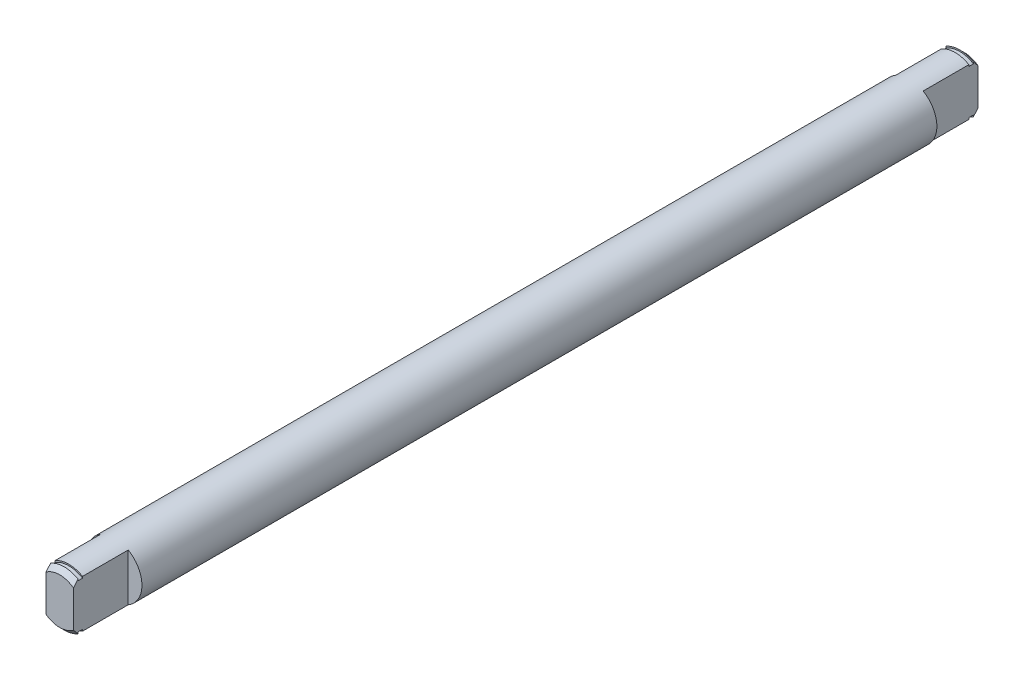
ISO-10303-21;
HEADER;
FILE_DESCRIPTION(('STEP AP214'),'2;1');
FILE_NAME('part.step','',(''),(''),'','','');
FILE_SCHEMA(('AUTOMOTIVE_DESIGN { 1 0 10303 214 1 1 1 1 }'));
ENDSEC;
DATA;
#1=APPLICATION_CONTEXT('core data for automotive mechanical design processes');
#2=APPLICATION_PROTOCOL_DEFINITION('international standard','automotive_design',2000,#1);
#3=PRODUCT_CONTEXT('',#1,'mechanical');
#4=PRODUCT('Part','Part','',(#3));
#5=PRODUCT_RELATED_PRODUCT_CATEGORY('part','',(#4));
#6=PRODUCT_DEFINITION_FORMATION('','',#4);
#7=PRODUCT_DEFINITION_CONTEXT('part definition',#1,'design');
#8=PRODUCT_DEFINITION('design','',#6,#7);
#9=PRODUCT_DEFINITION_SHAPE('','',#8);
#10=(LENGTH_UNIT() NAMED_UNIT(*) SI_UNIT(.MILLI.,.METRE.));
#11=(NAMED_UNIT(*) PLANE_ANGLE_UNIT() SI_UNIT($,.RADIAN.));
#12=(NAMED_UNIT(*) SI_UNIT($,.STERADIAN.) SOLID_ANGLE_UNIT());
#13=UNCERTAINTY_MEASURE_WITH_UNIT(LENGTH_MEASURE(1.E-05),#10,'distance_accuracy_value','');
#14=(GEOMETRIC_REPRESENTATION_CONTEXT(3) GLOBAL_UNCERTAINTY_ASSIGNED_CONTEXT((#13)) GLOBAL_UNIT_ASSIGNED_CONTEXT((#10,
#11,#12)) REPRESENTATION_CONTEXT('',''));
#15=CARTESIAN_POINT('',(0.,0.,0.));
#16=DIRECTION('',(0.,0.,1.));
#17=DIRECTION('',(1.,0.,0.));
#18=AXIS2_PLACEMENT_3D('',#15,#16,#17);
#19=CARTESIAN_POINT('',(0.,0.,49.5));
#20=DIRECTION('',(0.,0.,-1.));
#21=DIRECTION('',(-1.,0.,0.));
#22=AXIS2_PLACEMENT_3D('',#19,#20,#21);
#23=CYLINDRICAL_SURFACE('',#22,3.);
#24=DIRECTION('',(0.,0.,-1.));
#25=VECTOR('',#24,1.);
#26=CARTESIAN_POINT('',(-1.5,2.59807621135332,49.5));
#27=LINE('',#26,#25);
#28=CARTESIAN_POINT('',(-1.5,2.59807621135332,48.5));
#29=VERTEX_POINT('',#28);
#30=CARTESIAN_POINT('',(-1.5,2.59807621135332,43.5));
#31=VERTEX_POINT('',#30);
#32=EDGE_CURVE('E354',#29,#31,#27,.T.);
#33=ORIENTED_EDGE('',*,*,#32,.F.);
#34=CARTESIAN_POINT('',(0.,0.,48.5));
#35=DIRECTION('',(0.,0.,-1.));
#36=DIRECTION('',(-1.,0.,0.));
#37=AXIS2_PLACEMENT_3D('',#34,#35,#36);
#38=CIRCLE('',#37,3.);
#39=CARTESIAN_POINT('',(1.5,2.59807621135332,48.5));
#40=VERTEX_POINT('',#39);
#41=EDGE_CURVE('E318',#29,#40,#38,.T.);
#42=ORIENTED_EDGE('',*,*,#41,.T.);
#43=DIRECTION('',(0.,0.,-1.));
#44=VECTOR('',#43,1.);
#45=CARTESIAN_POINT('',(1.5,2.59807621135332,49.5));
#46=LINE('',#45,#44);
#47=CARTESIAN_POINT('',(1.5,2.59807621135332,43.5));
#48=VERTEX_POINT('',#47);
#49=EDGE_CURVE('E390',#48,#40,#46,.F.);
#50=ORIENTED_EDGE('',*,*,#49,.F.);
#51=CARTESIAN_POINT('',(0.,0.,43.5));
#52=DIRECTION('',(0.,0.,1.));
#53=DIRECTION('',(1.,0.,0.));
#54=AXIS2_PLACEMENT_3D('',#51,#52,#53);
#55=CIRCLE('',#54,3.);
#56=CARTESIAN_POINT('',(1.5,-2.59807621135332,43.5));
#57=VERTEX_POINT('',#56);
#58=EDGE_CURVE('E36',#57,#48,#55,.T.);
#59=ORIENTED_EDGE('',*,*,#58,.F.);
#60=DIRECTION('',(0.,0.,-1.));
#61=VECTOR('',#60,1.);
#62=CARTESIAN_POINT('',(1.5,-2.59807621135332,49.5));
#63=LINE('',#62,#61);
#64=CARTESIAN_POINT('',(1.5,-2.59807621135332,48.5));
#65=VERTEX_POINT('',#64);
#66=EDGE_CURVE('E395',#65,#57,#63,.T.);
#67=ORIENTED_EDGE('',*,*,#66,.F.);
#68=CARTESIAN_POINT('',(-1.5,-2.59807621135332,48.5));
#69=VERTEX_POINT('',#68);
#70=EDGE_CURVE('E420',#65,#69,#38,.T.);
#71=ORIENTED_EDGE('',*,*,#70,.T.);
#72=DIRECTION('',(0.,0.,-1.));
#73=VECTOR('',#72,1.);
#74=CARTESIAN_POINT('',(-1.5,-2.59807621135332,49.5));
#75=LINE('',#74,#73);
#76=CARTESIAN_POINT('',(-1.5,-2.59807621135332,43.5));
#77=VERTEX_POINT('',#76);
#78=EDGE_CURVE('E403',#77,#69,#75,.F.);
#79=ORIENTED_EDGE('',*,*,#78,.F.);
#80=EDGE_CURVE('E12',#31,#77,#55,.T.);
#81=ORIENTED_EDGE('',*,*,#80,.F.);
#82=EDGE_LOOP('',(#33,#42,#50,#59,#67,#71,#79,#81));
#83=FACE_BOUND('',#82,.T.);
#84=DIRECTION('',(0.,0.,1.));
#85=VECTOR('',#84,1.);
#86=CARTESIAN_POINT('',(-1.5,2.59807621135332,-49.5));
#87=LINE('',#86,#85);
#88=CARTESIAN_POINT('',(-1.5,2.59807621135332,-48.5));
#89=VERTEX_POINT('',#88);
#90=CARTESIAN_POINT('',(-1.5,2.59807621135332,-43.5));
#91=VERTEX_POINT('',#90);
#92=EDGE_CURVE('E260',#89,#91,#87,.T.);
#93=ORIENTED_EDGE('',*,*,#92,.T.);
#94=CARTESIAN_POINT('',(0.,0.,-43.5));
#95=DIRECTION('',(0.,0.,1.));
#96=DIRECTION('',(1.,0.,0.));
#97=AXIS2_PLACEMENT_3D('',#94,#95,#96);
#98=CIRCLE('',#97,3.);
#99=CARTESIAN_POINT('',(-1.5,-2.59807621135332,-43.5));
#100=VERTEX_POINT('',#99);
#101=EDGE_CURVE('E360',#91,#100,#98,.T.);
#102=ORIENTED_EDGE('',*,*,#101,.T.);
#103=DIRECTION('',(0.,0.,1.));
#104=VECTOR('',#103,1.);
#105=CARTESIAN_POINT('',(-1.5,-2.59807621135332,-49.5));
#106=LINE('',#105,#104);
#107=CARTESIAN_POINT('',(-1.5,-2.59807621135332,-48.5));
#108=VERTEX_POINT('',#107);
#109=EDGE_CURVE('E254',#100,#108,#106,.F.);
#110=ORIENTED_EDGE('',*,*,#109,.T.);
#111=CARTESIAN_POINT('',(0.,0.,-48.5));
#112=DIRECTION('',(0.,0.,-1.));
#113=DIRECTION('',(-1.,0.,0.));
#114=AXIS2_PLACEMENT_3D('',#111,#112,#113);
#115=CIRCLE('',#114,3.);
#116=CARTESIAN_POINT('',(1.5,-2.59807621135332,-48.5));
#117=VERTEX_POINT('',#116);
#118=EDGE_CURVE('E273',#117,#108,#115,.T.);
#119=ORIENTED_EDGE('',*,*,#118,.F.);
#120=DIRECTION('',(0.,0.,1.));
#121=VECTOR('',#120,1.);
#122=CARTESIAN_POINT('',(1.5,-2.59807621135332,-49.5));
#123=LINE('',#122,#121);
#124=CARTESIAN_POINT('',(1.5,-2.59807621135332,-43.5));
#125=VERTEX_POINT('',#124);
#126=EDGE_CURVE('E241',#117,#125,#123,.T.);
#127=ORIENTED_EDGE('',*,*,#126,.T.);
#128=CARTESIAN_POINT('',(1.5,2.59807621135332,-43.5));
#129=VERTEX_POINT('',#128);
#130=EDGE_CURVE('E369',#125,#129,#98,.T.);
#131=ORIENTED_EDGE('',*,*,#130,.T.);
#132=DIRECTION('',(0.,0.,1.));
#133=VECTOR('',#132,1.);
#134=CARTESIAN_POINT('',(1.5,2.59807621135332,-49.5));
#135=LINE('',#134,#133);
#136=CARTESIAN_POINT('',(1.5,2.59807621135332,-48.5));
#137=VERTEX_POINT('',#136);
#138=EDGE_CURVE('E235',#129,#137,#135,.F.);
#139=ORIENTED_EDGE('',*,*,#138,.T.);
#140=EDGE_CURVE('E214',#89,#137,#115,.T.);
#141=ORIENTED_EDGE('',*,*,#140,.F.);
#142=EDGE_LOOP('',(#93,#102,#110,#119,#127,#131,#139,#141));
#143=FACE_BOUND('',#142,.T.);
#144=ADVANCED_FACE('F33',(#83,#143),#23,.T.);
#145=CARTESIAN_POINT('',(0.,4.74620758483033,48.5));
#146=DIRECTION('',(0.,0.,-1.));
#147=DIRECTION('',(-1.,0.,0.));
#148=AXIS2_PLACEMENT_3D('',#145,#146,#147);
#149=PLANE('',#148);
#150=DIRECTION('',(0.,1.,0.));
#151=VECTOR('',#150,1.);
#152=CARTESIAN_POINT('',(-1.5,4.74620758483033,48.5));
#153=LINE('',#152,#151);
#154=CARTESIAN_POINT('',(-1.5,-2.42332416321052,48.5));
#155=VERTEX_POINT('',#154);
#156=EDGE_CURVE('E401',#69,#155,#153,.T.);
#157=ORIENTED_EDGE('',*,*,#156,.F.);
#158=ORIENTED_EDGE('',*,*,#70,.F.);
#159=DIRECTION('',(0.,-1.,0.));
#160=VECTOR('',#159,1.);
#161=CARTESIAN_POINT('',(1.5,4.74620758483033,48.5));
#162=LINE('',#161,#160);
#163=CARTESIAN_POINT('',(1.5,-2.42332416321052,48.5));
#164=VERTEX_POINT('',#163);
#165=EDGE_CURVE('E391',#164,#65,#162,.T.);
#166=ORIENTED_EDGE('',*,*,#165,.F.);
#167=CARTESIAN_POINT('',(0.,0.,48.5));
#168=DIRECTION('',(0.,0.,-1.));
#169=DIRECTION('',(-1.,0.,0.));
#170=AXIS2_PLACEMENT_3D('',#167,#168,#169);
#171=CIRCLE('',#170,2.84999999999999);
#172=EDGE_CURVE('E413',#164,#155,#171,.T.);
#173=ORIENTED_EDGE('',*,*,#172,.T.);
#174=EDGE_LOOP('',(#157,#158,#166,#173));
#175=FACE_BOUND('',#174,.T.);
#176=ADVANCED_FACE('F330',(#175),#149,.F.);
#177=CARTESIAN_POINT('',(-1.5,2.42332416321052,48.5));
#178=VERTEX_POINT('',#177);
#179=EDGE_CURVE('E404',#178,#29,#153,.T.);
#180=ORIENTED_EDGE('',*,*,#179,.F.);
#181=CARTESIAN_POINT('',(1.5,2.42332416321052,48.5));
#182=VERTEX_POINT('',#181);
#183=EDGE_CURVE('E414',#178,#182,#171,.T.);
#184=ORIENTED_EDGE('',*,*,#183,.T.);
#185=EDGE_CURVE('E388',#40,#182,#162,.T.);
#186=ORIENTED_EDGE('',*,*,#185,.F.);
#187=ORIENTED_EDGE('',*,*,#41,.F.);
#188=EDGE_LOOP('',(#180,#184,#186,#187));
#189=FACE_BOUND('',#188,.T.);
#190=ADVANCED_FACE('F348',(#189),#149,.F.);
#191=CARTESIAN_POINT('',(0.,0.,0.));
#192=DIRECTION('',(0.,0.,-1.));
#193=DIRECTION('',(-1.,0.,0.));
#194=AXIS2_PLACEMENT_3D('',#191,#192,#193);
#195=CYLINDRICAL_SURFACE('',#194,2.84999999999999);
#196=DIRECTION('',(0.,0.,-1.));
#197=VECTOR('',#196,1.);
#198=CARTESIAN_POINT('',(-1.5,2.42332416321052,0.));
#199=LINE('',#198,#197);
#200=CARTESIAN_POINT('',(-1.5,2.42332416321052,49.));
#201=VERTEX_POINT('',#200);
#202=EDGE_CURVE('E406',#201,#178,#199,.T.);
#203=ORIENTED_EDGE('',*,*,#202,.F.);
#204=CARTESIAN_POINT('',(0.,0.,49.));
#205=DIRECTION('',(0.,0.,-1.));
#206=DIRECTION('',(-1.,0.,0.));
#207=AXIS2_PLACEMENT_3D('',#204,#205,#206);
#208=CIRCLE('',#207,2.84999999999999);
#209=CARTESIAN_POINT('',(1.5,2.42332416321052,49.));
#210=VERTEX_POINT('',#209);
#211=EDGE_CURVE('E410',#201,#210,#208,.T.);
#212=ORIENTED_EDGE('',*,*,#211,.T.);
#213=DIRECTION('',(0.,0.,-1.));
#214=VECTOR('',#213,1.);
#215=CARTESIAN_POINT('',(1.5,2.42332416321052,0.));
#216=LINE('',#215,#214);
#217=EDGE_CURVE('E385',#182,#210,#216,.F.);
#218=ORIENTED_EDGE('',*,*,#217,.F.);
#219=ORIENTED_EDGE('',*,*,#183,.F.);
#220=EDGE_LOOP('',(#203,#212,#218,#219));
#221=FACE_BOUND('',#220,.T.);
#222=ADVANCED_FACE('F462',(#221),#195,.T.);
#223=DIRECTION('',(0.,0.,-1.));
#224=VECTOR('',#223,1.);
#225=CARTESIAN_POINT('',(-1.5,-2.42332416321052,0.));
#226=LINE('',#225,#224);
#227=CARTESIAN_POINT('',(-1.5,-2.42332416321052,49.));
#228=VERTEX_POINT('',#227);
#229=EDGE_CURVE('E398',#155,#228,#226,.F.);
#230=ORIENTED_EDGE('',*,*,#229,.F.);
#231=ORIENTED_EDGE('',*,*,#172,.F.);
#232=DIRECTION('',(0.,0.,-1.));
#233=VECTOR('',#232,1.);
#234=CARTESIAN_POINT('',(1.5,-2.42332416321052,0.));
#235=LINE('',#234,#233);
#236=CARTESIAN_POINT('',(1.5,-2.42332416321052,49.));
#237=VERTEX_POINT('',#236);
#238=EDGE_CURVE('E393',#237,#164,#235,.T.);
#239=ORIENTED_EDGE('',*,*,#238,.F.);
#240=EDGE_CURVE('E409',#237,#228,#208,.T.);
#241=ORIENTED_EDGE('',*,*,#240,.T.);
#242=EDGE_LOOP('',(#230,#231,#239,#241));
#243=FACE_BOUND('',#242,.T.);
#244=ADVANCED_FACE('F441',(#243),#195,.T.);
#245=CARTESIAN_POINT('',(0.,4.74620758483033,49.));
#246=DIRECTION('',(0.,0.,1.));
#247=DIRECTION('',(1.,0.,0.));
#248=AXIS2_PLACEMENT_3D('',#245,#246,#247);
#249=PLANE('',#248);
#250=DIRECTION('',(0.,-1.,0.));
#251=VECTOR('',#250,1.);
#252=CARTESIAN_POINT('',(-1.5,4.74620758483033,49.));
#253=LINE('',#252,#251);
#254=CARTESIAN_POINT('',(-1.5,2.59807621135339,49.));
#255=VERTEX_POINT('',#254);
#256=EDGE_CURVE('E399',#255,#201,#253,.T.);
#257=ORIENTED_EDGE('',*,*,#256,.F.);
#258=CARTESIAN_POINT('',(0.,0.,49.));
#259=DIRECTION('',(0.,0.,1.));
#260=DIRECTION('',(1.,0.,0.));
#261=AXIS2_PLACEMENT_3D('',#258,#259,#260);
#262=CIRCLE('',#261,2.99999999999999);
#263=CARTESIAN_POINT('',(1.5,2.59807621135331,49.));
#264=VERTEX_POINT('',#263);
#265=EDGE_CURVE('E417',#255,#264,#262,.F.);
#266=ORIENTED_EDGE('',*,*,#265,.T.);
#267=DIRECTION('',(0.,1.,0.));
#268=VECTOR('',#267,1.);
#269=CARTESIAN_POINT('',(1.5,4.74620758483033,49.));
#270=LINE('',#269,#268);
#271=EDGE_CURVE('E47',#210,#264,#270,.T.);
#272=ORIENTED_EDGE('',*,*,#271,.F.);
#273=ORIENTED_EDGE('',*,*,#211,.F.);
#274=EDGE_LOOP('',(#257,#266,#272,#273));
#275=FACE_BOUND('',#274,.T.);
#276=ADVANCED_FACE('F339',(#275),#249,.F.);
#277=CARTESIAN_POINT('',(-1.5,-2.59807621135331,49.));
#278=VERTEX_POINT('',#277);
#279=EDGE_CURVE('E55',#228,#278,#253,.T.);
#280=ORIENTED_EDGE('',*,*,#279,.F.);
#281=ORIENTED_EDGE('',*,*,#240,.F.);
#282=CARTESIAN_POINT('',(1.5,-2.59807621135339,49.));
#283=VERTEX_POINT('',#282);
#284=EDGE_CURVE('E386',#283,#237,#270,.T.);
#285=ORIENTED_EDGE('',*,*,#284,.F.);
#286=EDGE_CURVE('E418',#283,#278,#262,.F.);
#287=ORIENTED_EDGE('',*,*,#286,.T.);
#288=EDGE_LOOP('',(#280,#281,#285,#287));
#289=FACE_BOUND('',#288,.T.);
#290=ADVANCED_FACE('F334',(#289),#249,.F.);
#291=CARTESIAN_POINT('',(0.,0.,49.5));
#292=DIRECTION('',(0.,0.,1.));
#293=DIRECTION('',(1.,0.,0.));
#294=AXIS2_PLACEMENT_3D('',#291,#292,#293);
#295=PLANE('',#294);
#296=CARTESIAN_POINT('',(0.,0.,49.5));
#297=DIRECTION('',(0.,0.,1.));
#298=DIRECTION('',(1.,0.,0.));
#299=AXIS2_PLACEMENT_3D('',#296,#297,#298);
#300=CIRCLE('',#299,2.5);
#301=CARTESIAN_POINT('',(1.5,1.99999999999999,49.5));
#302=VERTEX_POINT('',#301);
#303=CARTESIAN_POINT('',(-1.5,1.99999999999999,49.5));
#304=VERTEX_POINT('',#303);
#305=EDGE_CURVE('E317',#302,#304,#300,.T.);
#306=ORIENTED_EDGE('',*,*,#305,.T.);
#307=DIRECTION('',(0.,-1.,0.));
#308=VECTOR('',#307,1.);
#309=CARTESIAN_POINT('',(-1.5,5.,49.5));
#310=LINE('',#309,#308);
#311=CARTESIAN_POINT('',(-1.5,-1.99999999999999,49.5));
#312=VERTEX_POINT('',#311);
#313=EDGE_CURVE('E368',#304,#312,#310,.T.);
#314=ORIENTED_EDGE('',*,*,#313,.T.);
#315=CARTESIAN_POINT('',(1.5,-1.99999999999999,49.5));
#316=VERTEX_POINT('',#315);
#317=EDGE_CURVE('E422',#312,#316,#300,.T.);
#318=ORIENTED_EDGE('',*,*,#317,.T.);
#319=DIRECTION('',(0.,1.,0.));
#320=VECTOR('',#319,1.);
#321=CARTESIAN_POINT('',(1.5,5.,49.5));
#322=LINE('',#321,#320);
#323=EDGE_CURVE('E371',#316,#302,#322,.T.);
#324=ORIENTED_EDGE('',*,*,#323,.T.);
#325=EDGE_LOOP('',(#306,#314,#318,#324));
#326=FACE_BOUND('',#325,.T.);
#327=ADVANCED_FACE('F328',(#326),#295,.T.);
#328=CARTESIAN_POINT('',(0.,0.,49.5));
#329=DIRECTION('',(0.,0.,-1.));
#330=DIRECTION('',(-1.,0.,0.));
#331=AXIS2_PLACEMENT_3D('',#328,#329,#330);
#332=CONICAL_SURFACE('',#331,2.5,0.785398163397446);
#333=ORIENTED_EDGE('',*,*,#265,.F.);
#334=CARTESIAN_POINT('',(-1.5,6.44030397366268,45.3873216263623));
#335=CARTESIAN_POINT('',(-1.5,6.27835677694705,45.5450370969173));
#336=CARTESIAN_POINT('',(-1.5,6.11626608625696,45.7026057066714));
#337=CARTESIAN_POINT('',(-1.5,5.79169279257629,46.0173501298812));
#338=CARTESIAN_POINT('',(-1.5,5.62921017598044,46.1745259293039));
#339=CARTESIAN_POINT('',(-1.5,5.30336474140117,46.4887552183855));
#340=CARTESIAN_POINT('',(-1.5,5.14000074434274,46.6458074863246));
#341=CARTESIAN_POINT('',(-1.5,4.81263846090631,46.9592405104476));
#342=CARTESIAN_POINT('',(-1.5,4.64864019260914,47.1156212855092));
#343=CARTESIAN_POINT('',(-1.5,4.29574135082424,47.4502970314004));
#344=CARTESIAN_POINT('',(-1.5,4.10670721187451,47.6284514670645));
#345=CARTESIAN_POINT('',(-1.5,3.72700159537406,47.9830448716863));
#346=CARTESIAN_POINT('',(-1.5,3.53632996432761,48.1594836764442));
#347=CARTESIAN_POINT('',(-1.5,3.15288488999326,48.5093775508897));
#348=CARTESIAN_POINT('',(-1.5,2.96011589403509,48.6828374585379));
#349=CARTESIAN_POINT('',(-1.5,2.6679792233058,48.9396076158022));
#350=CARTESIAN_POINT('',(-1.5,2.57011081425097,49.0246212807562));
#351=CARTESIAN_POINT('',(-1.5,2.37304745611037,49.1930942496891));
#352=CARTESIAN_POINT('',(-1.5,2.27385257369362,49.2765536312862));
#353=CARTESIAN_POINT('',(-1.5,2.10981416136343,49.4115631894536));
#354=CARTESIAN_POINT('',(-1.5,2.0454989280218,49.4637545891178));
#355=CARTESIAN_POINT('',(-1.5,1.91596831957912,49.5670178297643));
#356=CARTESIAN_POINT('',(-1.5,1.85075290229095,49.6180896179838));
#357=CARTESIAN_POINT('',(-1.5,1.71900835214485,49.7189504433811));
#358=CARTESIAN_POINT('',(-1.5,1.6524757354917,49.7687349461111));
#359=CARTESIAN_POINT('',(-1.5,1.5180264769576,49.8663957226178));
#360=CARTESIAN_POINT('',(-1.5,1.4501099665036,49.9142721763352));
#361=CARTESIAN_POINT('',(-1.5,1.31444992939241,50.0061703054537));
#362=CARTESIAN_POINT('',(-1.5,1.24675428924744,50.050262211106));
#363=CARTESIAN_POINT('',(-1.5,1.10927413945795,50.1351775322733));
#364=CARTESIAN_POINT('',(-1.5,1.0394886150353,50.1759993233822));
#365=CARTESIAN_POINT('',(-1.5,0.897766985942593,50.2528721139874));
#366=CARTESIAN_POINT('',(-1.5,0.82584362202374,50.2889463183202));
#367=CARTESIAN_POINT('',(-1.5,0.679166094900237,50.3547083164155));
#368=CARTESIAN_POINT('',(-1.5,0.604416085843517,50.3844050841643));
#369=CARTESIAN_POINT('',(-1.5,0.484591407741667,50.424202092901));
#370=CARTESIAN_POINT('',(-1.5,0.440496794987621,50.4372516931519));
#371=CARTESIAN_POINT('',(-1.5,0.351423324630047,50.4599854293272));
#372=CARTESIAN_POINT('',(-1.5,0.306444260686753,50.4696687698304));
#373=CARTESIAN_POINT('',(-1.5,0.216009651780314,50.4851780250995));
#374=CARTESIAN_POINT('',(-1.5,0.170556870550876,50.4910198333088));
#375=CARTESIAN_POINT('',(-1.5,0.0793114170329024,50.4985924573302));
#376=CARTESIAN_POINT('',(-1.5,0.033518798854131,50.50032391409));
#377=CARTESIAN_POINT('',(-1.5,-0.0581530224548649,50.4995749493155));
#378=CARTESIAN_POINT('',(-1.5,-0.104032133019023,50.4970833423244));
#379=CARTESIAN_POINT('',(-1.5,-0.195380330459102,50.4880123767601));
#380=CARTESIAN_POINT('',(-1.5,-0.240849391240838,50.4814327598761));
#381=CARTESIAN_POINT('',(-1.5,-0.331269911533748,50.4645010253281));
#382=CARTESIAN_POINT('',(-1.5,-0.37621835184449,50.45413300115));
#383=CARTESIAN_POINT('',(-1.5,-0.465213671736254,50.4300993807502));
#384=CARTESIAN_POINT('',(-1.5,-0.509260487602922,50.416433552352));
#385=CARTESIAN_POINT('',(-1.5,-0.649833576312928,50.3678292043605));
#386=CARTESIAN_POINT('',(-1.5,-0.744448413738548,50.3273611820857));
#387=CARTESIAN_POINT('',(-1.5,-0.929265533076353,50.2373341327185));
#388=CARTESIAN_POINT('',(-1.5,-1.01945854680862,50.1877569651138));
#389=CARTESIAN_POINT('',(-1.5,-1.19690759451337,50.0823263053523));
#390=CARTESIAN_POINT('',(-1.5,-1.2841387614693,50.026431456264));
#391=CARTESIAN_POINT('',(-1.5,-1.41287692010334,49.9396045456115));
#392=CARTESIAN_POINT('',(-1.5,-1.45541988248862,49.9101784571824));
#393=CARTESIAN_POINT('',(-1.5,-1.53990886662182,49.8504826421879));
#394=CARTESIAN_POINT('',(-1.5,-1.58185490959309,49.8202129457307));
#395=CARTESIAN_POINT('',(-1.5,-1.71506556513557,49.7223748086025));
#396=CARTESIAN_POINT('',(-1.5,-1.80534910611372,49.6534717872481));
#397=CARTESIAN_POINT('',(-1.5,-1.98408798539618,49.5133270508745));
#398=CARTESIAN_POINT('',(-1.5,-2.07254304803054,49.4420849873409));
#399=CARTESIAN_POINT('',(-1.5,-2.24810196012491,49.2978795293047));
#400=CARTESIAN_POINT('',(-1.5,-2.33520518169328,49.2249153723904));
#401=CARTESIAN_POINT('',(-1.5,-2.50833922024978,49.0777236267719));
#402=CARTESIAN_POINT('',(-1.5,-2.59437000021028,49.0034959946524));
#403=CARTESIAN_POINT('',(-1.5,-2.85149237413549,48.779141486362));
#404=CARTESIAN_POINT('',(-1.5,-3.02133035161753,48.6275795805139));
#405=CARTESIAN_POINT('',(-1.5,-3.35882124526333,48.3221484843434));
#406=CARTESIAN_POINT('',(-1.5,-3.52647473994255,48.1682799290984));
#407=CARTESIAN_POINT('',(-1.5,-3.85983495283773,47.8594198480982));
#408=CARTESIAN_POINT('',(-1.5,-4.02554592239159,47.7044329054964));
#409=CARTESIAN_POINT('',(-1.5,-4.35594593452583,47.3933535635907));
#410=CARTESIAN_POINT('',(-1.5,-4.52063490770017,47.2372610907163));
#411=CARTESIAN_POINT('',(-1.5,-5.0133324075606,46.7680443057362));
#412=CARTESIAN_POINT('',(-1.5,-5.34022261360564,46.4537460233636));
#413=CARTESIAN_POINT('',(-1.5,-5.73087171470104,46.0760963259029));
#414=CARTESIAN_POINT('',(-1.5,-5.79545591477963,46.0135939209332));
#415=CARTESIAN_POINT('',(-1.5,-5.92456669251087,45.8885165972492));
#416=CARTESIAN_POINT('',(-1.5,-5.98909326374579,45.8259416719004));
#417=CARTESIAN_POINT('',(-1.5,-6.11810091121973,45.7007207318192));
#418=CARTESIAN_POINT('',(-1.5,-6.18258197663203,45.6380747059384));
#419=CARTESIAN_POINT('',(-1.5,-6.31148470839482,45.5127345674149));
#420=CARTESIAN_POINT('',(-1.5,-6.37590638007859,45.4500404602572));
#421=CARTESIAN_POINT('',(-1.5,-6.44030397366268,45.3873216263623));
#422=B_SPLINE_CURVE_WITH_KNOTS('',3,(#334,#335,#336,#337,#338,#339,#340,#341,#342,#343,#344,
#345,#346,#347,#348,#349,#350,#351,#352,#353,#354,#355,#356,#357,#358,#359,#360,#361,#362,#363,
#364,#365,#366,#367,#368,#369,#370,#371,#372,#373,#374,#375,#376,#377,#378,#379,#380,#381,#382,
#383,#384,#385,#386,#387,#388,#389,#390,#391,#392,#393,#394,#395,#396,#397,#398,#399,#400,#401,
#402,#403,#404,#405,#406,#407,#408,#409,#410,#411,#412,#413,#414,#415,#416,#417,#418,#419,#420,
#421),.UNSPECIFIED.,.F.,.F.,(4,2,2,2,2,2,2,2,2,2,2,2,2,2,2,2,2,2,2,2,2,2,2,2,2,2,2,2,2,2,2,2,2,
2,2,2,2,2,2,2,2,2,2,4),(0.,0.67816673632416,1.35635736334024,2.03619323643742,2.7160098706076,
3.49526817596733,4.27460034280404,5.05251678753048,5.44141491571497,5.83029357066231,
6.07876659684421,6.32725130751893,6.57651673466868,6.82575859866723,7.06805724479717,
7.31047551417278,7.55166103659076,7.79250491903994,7.93035124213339,8.06823011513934,
8.20553489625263,8.34281826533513,8.48046581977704,8.61812207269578,8.75636307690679,
8.89461381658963,9.20247327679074,9.51095260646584,9.82158311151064,9.97676134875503,
10.131934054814,10.4725892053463,10.813295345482,11.1541552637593,11.4950269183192,
12.1778780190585,12.860544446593,13.5412201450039,14.2219415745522,15.5823535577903,
15.8519812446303,16.1216359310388,16.3913412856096,16.66101944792),.UNSPECIFIED.);
#423=EDGE_CURVE('E448',#255,#304,#422,.T.);
#424=ORIENTED_EDGE('',*,*,#423,.T.);
#425=ORIENTED_EDGE('',*,*,#305,.F.);
#426=CARTESIAN_POINT('',(1.5,-6.44030397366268,45.3873216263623));
#427=CARTESIAN_POINT('',(1.5,-6.27835677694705,45.5450370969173));
#428=CARTESIAN_POINT('',(1.5,-6.11626608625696,45.7026057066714));
#429=CARTESIAN_POINT('',(1.5,-5.79169279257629,46.0173501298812));
#430=CARTESIAN_POINT('',(1.5,-5.62921017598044,46.1745259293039));
#431=CARTESIAN_POINT('',(1.5,-5.30336474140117,46.4887552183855));
#432=CARTESIAN_POINT('',(1.5,-5.14000074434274,46.6458074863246));
#433=CARTESIAN_POINT('',(1.5,-4.81263846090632,46.9592405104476));
#434=CARTESIAN_POINT('',(1.5,-4.64864019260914,47.1156212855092));
#435=CARTESIAN_POINT('',(1.5,-4.29574135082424,47.4502970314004));
#436=CARTESIAN_POINT('',(1.5,-4.10670721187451,47.6284514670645));
#437=CARTESIAN_POINT('',(1.5,-3.72700159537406,47.9830448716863));
#438=CARTESIAN_POINT('',(1.5,-3.53632996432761,48.1594836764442));
#439=CARTESIAN_POINT('',(1.5,-3.15288488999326,48.5093775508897));
#440=CARTESIAN_POINT('',(1.5,-2.96011589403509,48.6828374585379));
#441=CARTESIAN_POINT('',(1.5,-2.6679792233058,48.9396076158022));
#442=CARTESIAN_POINT('',(1.5,-2.57011081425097,49.0246212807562));
#443=CARTESIAN_POINT('',(1.5,-2.37304745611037,49.1930942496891));
#444=CARTESIAN_POINT('',(1.5,-2.27385257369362,49.2765536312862));
#445=CARTESIAN_POINT('',(1.5,-2.10981416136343,49.4115631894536));
#446=CARTESIAN_POINT('',(1.5,-2.0454989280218,49.4637545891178));
#447=CARTESIAN_POINT('',(1.5,-1.91596831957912,49.5670178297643));
#448=CARTESIAN_POINT('',(1.5,-1.85075290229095,49.6180896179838));
#449=CARTESIAN_POINT('',(1.5,-1.71900835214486,49.7189504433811));
#450=CARTESIAN_POINT('',(1.5,-1.6524757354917,49.7687349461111));
#451=CARTESIAN_POINT('',(1.5,-1.5180264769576,49.8663957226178));
#452=CARTESIAN_POINT('',(1.5,-1.4501099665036,49.9142721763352));
#453=CARTESIAN_POINT('',(1.5,-1.31444992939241,50.0061703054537));
#454=CARTESIAN_POINT('',(1.5,-1.24675428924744,50.050262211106));
#455=CARTESIAN_POINT('',(1.5,-1.10927413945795,50.1351775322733));
#456=CARTESIAN_POINT('',(1.5,-1.0394886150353,50.1759993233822));
#457=CARTESIAN_POINT('',(1.5,-0.897766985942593,50.2528721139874));
#458=CARTESIAN_POINT('',(1.5,-0.825843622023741,50.2889463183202));
#459=CARTESIAN_POINT('',(1.5,-0.679166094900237,50.3547083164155));
#460=CARTESIAN_POINT('',(1.5,-0.604416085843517,50.3844050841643));
#461=CARTESIAN_POINT('',(1.5,-0.484591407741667,50.424202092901));
#462=CARTESIAN_POINT('',(1.5,-0.440496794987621,50.4372516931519));
#463=CARTESIAN_POINT('',(1.5,-0.351423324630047,50.4599854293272));
#464=CARTESIAN_POINT('',(1.5,-0.306444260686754,50.4696687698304));
#465=CARTESIAN_POINT('',(1.5,-0.216009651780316,50.4851780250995));
#466=CARTESIAN_POINT('',(1.5,-0.170556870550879,50.4910198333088));
#467=CARTESIAN_POINT('',(1.5,-0.0793114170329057,50.4985924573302));
#468=CARTESIAN_POINT('',(1.5,-0.0335187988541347,50.50032391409));
#469=CARTESIAN_POINT('',(1.5,0.0581530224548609,50.4995749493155));
#470=CARTESIAN_POINT('',(1.5,0.104032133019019,50.4970833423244));
#471=CARTESIAN_POINT('',(1.5,0.195380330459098,50.4880123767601));
#472=CARTESIAN_POINT('',(1.5,0.240849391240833,50.4814327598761));
#473=CARTESIAN_POINT('',(1.5,0.331269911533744,50.4645010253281));
#474=CARTESIAN_POINT('',(1.5,0.376218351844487,50.45413300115));
#475=CARTESIAN_POINT('',(1.5,0.46521367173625,50.4300993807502));
#476=CARTESIAN_POINT('',(1.5,0.509260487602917,50.416433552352));
#477=CARTESIAN_POINT('',(1.5,0.649833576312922,50.3678292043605));
#478=CARTESIAN_POINT('',(1.5,0.744448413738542,50.3273611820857));
#479=CARTESIAN_POINT('',(1.5,0.929265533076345,50.2373341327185));
#480=CARTESIAN_POINT('',(1.5,1.01945854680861,50.1877569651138));
#481=CARTESIAN_POINT('',(1.5,1.19690759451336,50.0823263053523));
#482=CARTESIAN_POINT('',(1.5,1.28413876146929,50.026431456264));
#483=CARTESIAN_POINT('',(1.5,1.41287692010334,49.9396045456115));
#484=CARTESIAN_POINT('',(1.5,1.45541988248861,49.9101784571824));
#485=CARTESIAN_POINT('',(1.5,1.53990886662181,49.8504826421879));
#486=CARTESIAN_POINT('',(1.5,1.58185490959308,49.8202129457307));
#487=CARTESIAN_POINT('',(1.5,1.71506556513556,49.7223748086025));
#488=CARTESIAN_POINT('',(1.5,1.80534910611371,49.6534717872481));
#489=CARTESIAN_POINT('',(1.5,1.98408798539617,49.5133270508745));
#490=CARTESIAN_POINT('',(1.5,2.07254304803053,49.4420849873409));
#491=CARTESIAN_POINT('',(1.5,2.2481019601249,49.2978795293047));
#492=CARTESIAN_POINT('',(1.5,2.33520518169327,49.2249153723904));
#493=CARTESIAN_POINT('',(1.5,2.50833922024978,49.0777236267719));
#494=CARTESIAN_POINT('',(1.5,2.59437000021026,49.0034959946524));
#495=CARTESIAN_POINT('',(1.5,2.85149237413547,48.7791414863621));
#496=CARTESIAN_POINT('',(1.5,3.0213303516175,48.6275795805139));
#497=CARTESIAN_POINT('',(1.5,3.3588212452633,48.3221484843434));
#498=CARTESIAN_POINT('',(1.5,3.52647473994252,48.1682799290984));
#499=CARTESIAN_POINT('',(1.5,3.8598349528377,47.8594198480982));
#500=CARTESIAN_POINT('',(1.5,4.02554592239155,47.7044329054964));
#501=CARTESIAN_POINT('',(1.5,4.3559459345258,47.3933535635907));
#502=CARTESIAN_POINT('',(1.5,4.52063490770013,47.2372610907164));
#503=CARTESIAN_POINT('',(1.5,5.01333240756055,46.7680443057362));
#504=CARTESIAN_POINT('',(1.5,5.34022261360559,46.4537460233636));
#505=CARTESIAN_POINT('',(1.5,5.73087171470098,46.0760963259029));
#506=CARTESIAN_POINT('',(1.5,5.79545591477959,46.0135939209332));
#507=CARTESIAN_POINT('',(1.5,5.92456669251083,45.8885165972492));
#508=CARTESIAN_POINT('',(1.5,5.98909326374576,45.8259416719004));
#509=CARTESIAN_POINT('',(1.5,6.11810091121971,45.7007207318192));
#510=CARTESIAN_POINT('',(1.5,6.18258197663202,45.6380747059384));
#511=CARTESIAN_POINT('',(1.5,6.31148470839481,45.5127345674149));
#512=CARTESIAN_POINT('',(1.5,6.37590638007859,45.4500404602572));
#513=CARTESIAN_POINT('',(1.5,6.44030397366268,45.3873216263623));
#514=B_SPLINE_CURVE_WITH_KNOTS('',3,(#426,#427,#428,#429,#430,#431,#432,#433,#434,#435,#436,
#437,#438,#439,#440,#441,#442,#443,#444,#445,#446,#447,#448,#449,#450,#451,#452,#453,#454,#455,
#456,#457,#458,#459,#460,#461,#462,#463,#464,#465,#466,#467,#468,#469,#470,#471,#472,#473,#474,
#475,#476,#477,#478,#479,#480,#481,#482,#483,#484,#485,#486,#487,#488,#489,#490,#491,#492,#493,
#494,#495,#496,#497,#498,#499,#500,#501,#502,#503,#504,#505,#506,#507,#508,#509,#510,#511,#512,
#513),.UNSPECIFIED.,.F.,.F.,(4,2,2,2,2,2,2,2,2,2,2,2,2,2,2,2,2,2,2,2,2,2,2,2,2,2,2,2,2,2,2,2,2,
2,2,2,2,2,2,2,2,2,2,4),(0.,0.67816673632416,1.35635736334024,2.03619323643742,2.7160098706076,
3.49526817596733,4.27460034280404,5.05251678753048,5.44141491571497,5.83029357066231,
6.07876659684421,6.32725130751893,6.57651673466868,6.82575859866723,7.06805724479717,
7.31047551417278,7.55166103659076,7.79250491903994,7.93035124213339,8.06823011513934,
8.20553489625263,8.34281826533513,8.48046581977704,8.61812207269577,8.75636307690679,
8.89461381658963,9.20247327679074,9.51095260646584,9.82158311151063,9.97676134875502,
10.131934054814,10.4725892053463,10.8132953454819,11.1541552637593,11.4950269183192,
12.1778780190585,12.860544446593,13.5412201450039,14.2219415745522,15.5823535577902,
15.8519812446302,16.1216359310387,16.3913412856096,16.66101944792),.UNSPECIFIED.);
#515=EDGE_CURVE('E310',#302,#264,#514,.T.);
#516=ORIENTED_EDGE('',*,*,#515,.T.);
#517=EDGE_LOOP('',(#333,#424,#425,#516));
#518=FACE_BOUND('',#517,.T.);
#519=ADVANCED_FACE('F324',(#518),#332,.T.);
#520=ORIENTED_EDGE('',*,*,#317,.F.);
#521=EDGE_CURVE('E320',#312,#278,#422,.T.);
#522=ORIENTED_EDGE('',*,*,#521,.T.);
#523=ORIENTED_EDGE('',*,*,#286,.F.);
#524=EDGE_CURVE('E316',#283,#316,#514,.T.);
#525=ORIENTED_EDGE('',*,*,#524,.T.);
#526=EDGE_LOOP('',(#520,#522,#523,#525));
#527=FACE_BOUND('',#526,.T.);
#528=ADVANCED_FACE('F305',(#527),#332,.T.);
#529=CARTESIAN_POINT('',(1.5,5.,43.5));
#530=DIRECTION('',(1.,0.,0.));
#531=DIRECTION('',(0.,1.,0.));
#532=AXIS2_PLACEMENT_3D('',#529,#530,#531);
#533=PLANE('',#532);
#534=ORIENTED_EDGE('',*,*,#66,.T.);
#535=DIRECTION('',(0.,1.,0.));
#536=VECTOR('',#535,1.);
#537=CARTESIAN_POINT('',(1.5,5.,43.5));
#538=LINE('',#537,#536);
#539=EDGE_CURVE('E381',#57,#48,#538,.T.);
#540=ORIENTED_EDGE('',*,*,#539,.T.);
#541=ORIENTED_EDGE('',*,*,#49,.T.);
#542=ORIENTED_EDGE('',*,*,#185,.T.);
#543=ORIENTED_EDGE('',*,*,#217,.T.);
#544=ORIENTED_EDGE('',*,*,#271,.T.);
#545=ORIENTED_EDGE('',*,*,#515,.F.);
#546=ORIENTED_EDGE('',*,*,#323,.F.);
#547=ORIENTED_EDGE('',*,*,#524,.F.);
#548=ORIENTED_EDGE('',*,*,#284,.T.);
#549=ORIENTED_EDGE('',*,*,#238,.T.);
#550=ORIENTED_EDGE('',*,*,#165,.T.);
#551=EDGE_LOOP('',(#534,#540,#541,#542,#543,#544,#545,#546,#547,#548,#549,#550));
#552=FACE_BOUND('',#551,.T.);
#553=ADVANCED_FACE('F300',(#552),#533,.T.);
#554=CARTESIAN_POINT('',(0.,0.,43.5));
#555=DIRECTION('',(0.,0.,1.));
#556=DIRECTION('',(1.,0.,0.));
#557=AXIS2_PLACEMENT_3D('',#554,#555,#556);
#558=PLANE('',#557);
#559=ORIENTED_EDGE('',*,*,#58,.T.);
#560=ORIENTED_EDGE('',*,*,#539,.F.);
#561=EDGE_LOOP('',(#559,#560));
#562=FACE_BOUND('',#561,.T.);
#563=ADVANCED_FACE('F304',(#562),#558,.T.);
#564=ORIENTED_EDGE('',*,*,#80,.T.);
#565=DIRECTION('',(0.,-1.,0.));
#566=VECTOR('',#565,1.);
#567=CARTESIAN_POINT('',(-1.5,5.,43.5));
#568=LINE('',#567,#566);
#569=EDGE_CURVE('E378',#31,#77,#568,.T.);
#570=ORIENTED_EDGE('',*,*,#569,.F.);
#571=EDGE_LOOP('',(#564,#570));
#572=FACE_BOUND('',#571,.T.);
#573=ADVANCED_FACE('F467',(#572),#558,.T.);
#574=CARTESIAN_POINT('',(-1.5,5.,43.5));
#575=DIRECTION('',(-1.,0.,0.));
#576=DIRECTION('',(0.,-1.,0.));
#577=AXIS2_PLACEMENT_3D('',#574,#575,#576);
#578=PLANE('',#577);
#579=ORIENTED_EDGE('',*,*,#32,.T.);
#580=ORIENTED_EDGE('',*,*,#569,.T.);
#581=ORIENTED_EDGE('',*,*,#78,.T.);
#582=ORIENTED_EDGE('',*,*,#156,.T.);
#583=ORIENTED_EDGE('',*,*,#229,.T.);
#584=ORIENTED_EDGE('',*,*,#279,.T.);
#585=ORIENTED_EDGE('',*,*,#521,.F.);
#586=ORIENTED_EDGE('',*,*,#313,.F.);
#587=ORIENTED_EDGE('',*,*,#423,.F.);
#588=ORIENTED_EDGE('',*,*,#256,.T.);
#589=ORIENTED_EDGE('',*,*,#202,.T.);
#590=ORIENTED_EDGE('',*,*,#179,.T.);
#591=EDGE_LOOP('',(#579,#580,#581,#582,#583,#584,#585,#586,#587,#588,#589,#590));
#592=FACE_BOUND('',#591,.T.);
#593=ADVANCED_FACE('F306',(#592),#578,.T.);
#594=CARTESIAN_POINT('',(0.,4.74620758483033,-48.5));
#595=DIRECTION('',(0.,0.,1.));
#596=DIRECTION('',(-1.,0.,0.));
#597=AXIS2_PLACEMENT_3D('',#594,#595,#596);
#598=PLANE('',#597);
#599=DIRECTION('',(0.,1.,0.));
#600=VECTOR('',#599,1.);
#601=CARTESIAN_POINT('',(-1.5,4.74620758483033,-48.5));
#602=LINE('',#601,#600);
#603=CARTESIAN_POINT('',(-1.5,-2.42332416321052,-48.5));
#604=VERTEX_POINT('',#603);
#605=EDGE_CURVE('E251',#108,#604,#602,.T.);
#606=ORIENTED_EDGE('',*,*,#605,.T.);
#607=CARTESIAN_POINT('',(0.,0.,-48.5));
#608=DIRECTION('',(0.,0.,-1.));
#609=DIRECTION('',(-1.,0.,0.));
#610=AXIS2_PLACEMENT_3D('',#607,#608,#609);
#611=CIRCLE('',#610,2.84999999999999);
#612=CARTESIAN_POINT('',(1.5,-2.42332416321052,-48.5));
#613=VERTEX_POINT('',#612);
#614=EDGE_CURVE('E267',#613,#604,#611,.T.);
#615=ORIENTED_EDGE('',*,*,#614,.F.);
#616=DIRECTION('',(0.,-1.,0.));
#617=VECTOR('',#616,1.);
#618=CARTESIAN_POINT('',(1.5,4.74620758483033,-48.5));
#619=LINE('',#618,#617);
#620=EDGE_CURVE('E236',#613,#117,#619,.T.);
#621=ORIENTED_EDGE('',*,*,#620,.T.);
#622=ORIENTED_EDGE('',*,*,#118,.T.);
#623=EDGE_LOOP('',(#606,#615,#621,#622));
#624=FACE_BOUND('',#623,.T.);
#625=ADVANCED_FACE('F294',(#624),#598,.F.);
#626=CARTESIAN_POINT('',(-1.5,2.42332416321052,-48.5));
#627=VERTEX_POINT('',#626);
#628=EDGE_CURVE('E255',#627,#89,#602,.T.);
#629=ORIENTED_EDGE('',*,*,#628,.T.);
#630=ORIENTED_EDGE('',*,*,#140,.T.);
#631=CARTESIAN_POINT('',(1.5,2.42332416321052,-48.5));
#632=VERTEX_POINT('',#631);
#633=EDGE_CURVE('E232',#137,#632,#619,.T.);
#634=ORIENTED_EDGE('',*,*,#633,.T.);
#635=EDGE_CURVE('E268',#627,#632,#611,.T.);
#636=ORIENTED_EDGE('',*,*,#635,.F.);
#637=EDGE_LOOP('',(#629,#630,#634,#636));
#638=FACE_BOUND('',#637,.T.);
#639=ADVANCED_FACE('F592',(#638),#598,.F.);
#640=CARTESIAN_POINT('',(0.,0.,0.));
#641=DIRECTION('',(0.,0.,1.));
#642=DIRECTION('',(-1.,0.,0.));
#643=AXIS2_PLACEMENT_3D('',#640,#641,#642);
#644=CYLINDRICAL_SURFACE('',#643,2.84999999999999);
#645=DIRECTION('',(0.,0.,1.));
#646=VECTOR('',#645,1.);
#647=CARTESIAN_POINT('',(-1.5,2.42332416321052,0.));
#648=LINE('',#647,#646);
#649=CARTESIAN_POINT('',(-1.5,2.42332416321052,-49.));
#650=VERTEX_POINT('',#649);
#651=EDGE_CURVE('E258',#650,#627,#648,.T.);
#652=ORIENTED_EDGE('',*,*,#651,.T.);
#653=ORIENTED_EDGE('',*,*,#635,.T.);
#654=DIRECTION('',(0.,0.,1.));
#655=VECTOR('',#654,1.);
#656=CARTESIAN_POINT('',(1.5,2.42332416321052,0.));
#657=LINE('',#656,#655);
#658=CARTESIAN_POINT('',(1.5,2.42332416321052,-49.));
#659=VERTEX_POINT('',#658);
#660=EDGE_CURVE('E229',#632,#659,#657,.F.);
#661=ORIENTED_EDGE('',*,*,#660,.T.);
#662=CARTESIAN_POINT('',(0.,0.,-49.));
#663=DIRECTION('',(0.,0.,-1.));
#664=DIRECTION('',(-1.,0.,0.));
#665=AXIS2_PLACEMENT_3D('',#662,#663,#664);
#666=CIRCLE('',#665,2.84999999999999);
#667=EDGE_CURVE('E264',#650,#659,#666,.T.);
#668=ORIENTED_EDGE('',*,*,#667,.F.);
#669=EDGE_LOOP('',(#652,#653,#661,#668));
#670=FACE_BOUND('',#669,.T.);
#671=ADVANCED_FACE('F563',(#670),#644,.T.);
#672=DIRECTION('',(0.,0.,1.));
#673=VECTOR('',#672,1.);
#674=CARTESIAN_POINT('',(-1.5,-2.42332416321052,0.));
#675=LINE('',#674,#673);
#676=CARTESIAN_POINT('',(-1.5,-2.42332416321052,-49.));
#677=VERTEX_POINT('',#676);
#678=EDGE_CURVE('E247',#604,#677,#675,.F.);
#679=ORIENTED_EDGE('',*,*,#678,.T.);
#680=CARTESIAN_POINT('',(1.5,-2.42332416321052,-49.));
#681=VERTEX_POINT('',#680);
#682=EDGE_CURVE('E263',#681,#677,#666,.T.);
#683=ORIENTED_EDGE('',*,*,#682,.F.);
#684=DIRECTION('',(0.,0.,1.));
#685=VECTOR('',#684,1.);
#686=CARTESIAN_POINT('',(1.5,-2.42332416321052,0.));
#687=LINE('',#686,#685);
#688=EDGE_CURVE('E239',#681,#613,#687,.T.);
#689=ORIENTED_EDGE('',*,*,#688,.T.);
#690=ORIENTED_EDGE('',*,*,#614,.T.);
#691=EDGE_LOOP('',(#679,#683,#689,#690));
#692=FACE_BOUND('',#691,.T.);
#693=ADVANCED_FACE('F557',(#692),#644,.T.);
#694=CARTESIAN_POINT('',(0.,4.74620758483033,-49.));
#695=DIRECTION('',(0.,0.,-1.));
#696=DIRECTION('',(1.,0.,0.));
#697=AXIS2_PLACEMENT_3D('',#694,#695,#696);
#698=PLANE('',#697);
#699=DIRECTION('',(0.,-1.,0.));
#700=VECTOR('',#699,1.);
#701=CARTESIAN_POINT('',(-1.5,4.74620758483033,-49.));
#702=LINE('',#701,#700);
#703=CARTESIAN_POINT('',(-1.5,2.59807621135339,-49.));
#704=VERTEX_POINT('',#703);
#705=EDGE_CURVE('E248',#704,#650,#702,.T.);
#706=ORIENTED_EDGE('',*,*,#705,.T.);
#707=ORIENTED_EDGE('',*,*,#667,.T.);
#708=DIRECTION('',(0.,1.,0.));
#709=VECTOR('',#708,1.);
#710=CARTESIAN_POINT('',(1.5,4.74620758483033,-49.));
#711=LINE('',#710,#709);
#712=CARTESIAN_POINT('',(1.5,2.59807621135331,-49.));
#713=VERTEX_POINT('',#712);
#714=EDGE_CURVE('E226',#659,#713,#711,.T.);
#715=ORIENTED_EDGE('',*,*,#714,.T.);
#716=CARTESIAN_POINT('',(0.,0.,-49.));
#717=DIRECTION('',(0.,0.,1.));
#718=DIRECTION('',(1.,0.,0.));
#719=AXIS2_PLACEMENT_3D('',#716,#717,#718);
#720=CIRCLE('',#719,2.99999999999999);
#721=EDGE_CURVE('E271',#704,#713,#720,.F.);
#722=ORIENTED_EDGE('',*,*,#721,.F.);
#723=EDGE_LOOP('',(#706,#707,#715,#722));
#724=FACE_BOUND('',#723,.T.);
#725=ADVANCED_FACE('F562',(#724),#698,.F.);
#726=CARTESIAN_POINT('',(-1.5,-2.59807621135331,-49.));
#727=VERTEX_POINT('',#726);
#728=EDGE_CURVE('E244',#677,#727,#702,.T.);
#729=ORIENTED_EDGE('',*,*,#728,.T.);
#730=CARTESIAN_POINT('',(1.5,-2.59807621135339,-49.));
#731=VERTEX_POINT('',#730);
#732=EDGE_CURVE('E272',#731,#727,#720,.F.);
#733=ORIENTED_EDGE('',*,*,#732,.F.);
#734=EDGE_CURVE('E200',#731,#681,#711,.T.);
#735=ORIENTED_EDGE('',*,*,#734,.T.);
#736=ORIENTED_EDGE('',*,*,#682,.T.);
#737=EDGE_LOOP('',(#729,#733,#735,#736));
#738=FACE_BOUND('',#737,.T.);
#739=ADVANCED_FACE('F299',(#738),#698,.F.);
#740=CARTESIAN_POINT('',(0.,0.,-49.5));
#741=DIRECTION('',(0.,0.,-1.));
#742=DIRECTION('',(1.,0.,0.));
#743=AXIS2_PLACEMENT_3D('',#740,#741,#742);
#744=PLANE('',#743);
#745=CARTESIAN_POINT('',(0.,0.,-49.5));
#746=DIRECTION('',(0.,0.,1.));
#747=DIRECTION('',(1.,0.,0.));
#748=AXIS2_PLACEMENT_3D('',#745,#746,#747);
#749=CIRCLE('',#748,2.5);
#750=CARTESIAN_POINT('',(1.5,1.99999999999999,-49.5));
#751=VERTEX_POINT('',#750);
#752=CARTESIAN_POINT('',(-1.5,1.99999999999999,-49.5));
#753=VERTEX_POINT('',#752);
#754=EDGE_CURVE('E213',#751,#753,#749,.T.);
#755=ORIENTED_EDGE('',*,*,#754,.F.);
#756=DIRECTION('',(0.,1.,0.));
#757=VECTOR('',#756,1.);
#758=CARTESIAN_POINT('',(1.5,5.,-49.5));
#759=LINE('',#758,#757);
#760=CARTESIAN_POINT('',(1.5,-1.99999999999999,-49.5));
#761=VERTEX_POINT('',#760);
#762=EDGE_CURVE('E197',#761,#751,#759,.T.);
#763=ORIENTED_EDGE('',*,*,#762,.F.);
#764=CARTESIAN_POINT('',(-1.5,-1.99999999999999,-49.5));
#765=VERTEX_POINT('',#764);
#766=EDGE_CURVE('E208',#765,#761,#749,.T.);
#767=ORIENTED_EDGE('',*,*,#766,.F.);
#768=DIRECTION('',(0.,-1.,0.));
#769=VECTOR('',#768,1.);
#770=CARTESIAN_POINT('',(-1.5,5.,-49.5));
#771=LINE('',#770,#769);
#772=EDGE_CURVE('E219',#753,#765,#771,.T.);
#773=ORIENTED_EDGE('',*,*,#772,.F.);
#774=EDGE_LOOP('',(#755,#763,#767,#773));
#775=FACE_BOUND('',#774,.T.);
#776=ADVANCED_FACE('F216',(#775),#744,.T.);
#777=CARTESIAN_POINT('',(0.,0.,-49.5));
#778=DIRECTION('',(0.,0.,1.));
#779=DIRECTION('',(-1.,0.,0.));
#780=AXIS2_PLACEMENT_3D('',#777,#778,#779);
#781=CONICAL_SURFACE('',#780,2.5,0.785398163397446);
#782=ORIENTED_EDGE('',*,*,#721,.T.);
#783=CARTESIAN_POINT('',(1.5,-6.44030397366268,-45.3873216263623));
#784=CARTESIAN_POINT('',(1.5,-6.27835677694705,-45.5450370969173));
#785=CARTESIAN_POINT('',(1.5,-6.11626608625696,-45.7026057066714));
#786=CARTESIAN_POINT('',(1.5,-5.79169279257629,-46.0173501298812));
#787=CARTESIAN_POINT('',(1.5,-5.62921017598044,-46.1745259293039));
#788=CARTESIAN_POINT('',(1.5,-5.30336474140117,-46.4887552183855));
#789=CARTESIAN_POINT('',(1.5,-5.14000074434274,-46.6458074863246));
#790=CARTESIAN_POINT('',(1.5,-4.81263846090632,-46.9592405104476));
#791=CARTESIAN_POINT('',(1.5,-4.64864019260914,-47.1156212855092));
#792=CARTESIAN_POINT('',(1.5,-4.29574135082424,-47.4502970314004));
#793=CARTESIAN_POINT('',(1.5,-4.10670721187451,-47.6284514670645));
#794=CARTESIAN_POINT('',(1.5,-3.72700159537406,-47.9830448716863));
#795=CARTESIAN_POINT('',(1.5,-3.53632996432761,-48.1594836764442));
#796=CARTESIAN_POINT('',(1.5,-3.15288488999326,-48.5093775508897));
#797=CARTESIAN_POINT('',(1.5,-2.96011589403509,-48.6828374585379));
#798=CARTESIAN_POINT('',(1.5,-2.6679792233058,-48.9396076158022));
#799=CARTESIAN_POINT('',(1.5,-2.57011081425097,-49.0246212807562));
#800=CARTESIAN_POINT('',(1.5,-2.37304745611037,-49.1930942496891));
#801=CARTESIAN_POINT('',(1.5,-2.27385257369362,-49.2765536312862));
#802=CARTESIAN_POINT('',(1.5,-2.10981416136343,-49.4115631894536));
#803=CARTESIAN_POINT('',(1.5,-2.0454989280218,-49.4637545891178));
#804=CARTESIAN_POINT('',(1.5,-1.91596831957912,-49.5670178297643));
#805=CARTESIAN_POINT('',(1.5,-1.85075290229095,-49.6180896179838));
#806=CARTESIAN_POINT('',(1.5,-1.71900835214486,-49.7189504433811));
#807=CARTESIAN_POINT('',(1.5,-1.6524757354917,-49.7687349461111));
#808=CARTESIAN_POINT('',(1.5,-1.5180264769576,-49.8663957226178));
#809=CARTESIAN_POINT('',(1.5,-1.4501099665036,-49.9142721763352));
#810=CARTESIAN_POINT('',(1.5,-1.31444992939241,-50.0061703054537));
#811=CARTESIAN_POINT('',(1.5,-1.24675428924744,-50.050262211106));
#812=CARTESIAN_POINT('',(1.5,-1.10927413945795,-50.1351775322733));
#813=CARTESIAN_POINT('',(1.5,-1.0394886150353,-50.1759993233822));
#814=CARTESIAN_POINT('',(1.5,-0.897766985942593,-50.2528721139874));
#815=CARTESIAN_POINT('',(1.5,-0.825843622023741,-50.2889463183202));
#816=CARTESIAN_POINT('',(1.5,-0.679166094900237,-50.3547083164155));
#817=CARTESIAN_POINT('',(1.5,-0.604416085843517,-50.3844050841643));
#818=CARTESIAN_POINT('',(1.5,-0.484591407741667,-50.424202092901));
#819=CARTESIAN_POINT('',(1.5,-0.440496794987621,-50.4372516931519));
#820=CARTESIAN_POINT('',(1.5,-0.351423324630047,-50.4599854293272));
#821=CARTESIAN_POINT('',(1.5,-0.306444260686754,-50.4696687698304));
#822=CARTESIAN_POINT('',(1.5,-0.216009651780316,-50.4851780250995));
#823=CARTESIAN_POINT('',(1.5,-0.170556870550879,-50.4910198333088));
#824=CARTESIAN_POINT('',(1.5,-0.0793114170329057,-50.4985924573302));
#825=CARTESIAN_POINT('',(1.5,-0.0335187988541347,-50.50032391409));
#826=CARTESIAN_POINT('',(1.5,0.0581530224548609,-50.4995749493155));
#827=CARTESIAN_POINT('',(1.5,0.104032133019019,-50.4970833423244));
#828=CARTESIAN_POINT('',(1.5,0.195380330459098,-50.4880123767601));
#829=CARTESIAN_POINT('',(1.5,0.240849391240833,-50.4814327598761));
#830=CARTESIAN_POINT('',(1.5,0.331269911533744,-50.4645010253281));
#831=CARTESIAN_POINT('',(1.5,0.376218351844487,-50.45413300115));
#832=CARTESIAN_POINT('',(1.5,0.46521367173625,-50.4300993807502));
#833=CARTESIAN_POINT('',(1.5,0.509260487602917,-50.416433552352));
#834=CARTESIAN_POINT('',(1.5,0.649833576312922,-50.3678292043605));
#835=CARTESIAN_POINT('',(1.5,0.744448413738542,-50.3273611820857));
#836=CARTESIAN_POINT('',(1.5,0.929265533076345,-50.2373341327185));
#837=CARTESIAN_POINT('',(1.5,1.01945854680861,-50.1877569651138));
#838=CARTESIAN_POINT('',(1.5,1.19690759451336,-50.0823263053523));
#839=CARTESIAN_POINT('',(1.5,1.28413876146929,-50.026431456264));
#840=CARTESIAN_POINT('',(1.5,1.41287692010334,-49.9396045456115));
#841=CARTESIAN_POINT('',(1.5,1.45541988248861,-49.9101784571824));
#842=CARTESIAN_POINT('',(1.5,1.53990886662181,-49.8504826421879));
#843=CARTESIAN_POINT('',(1.5,1.58185490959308,-49.8202129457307));
#844=CARTESIAN_POINT('',(1.5,1.71506556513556,-49.7223748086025));
#845=CARTESIAN_POINT('',(1.5,1.80534910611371,-49.6534717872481));
#846=CARTESIAN_POINT('',(1.5,1.98408798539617,-49.5133270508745));
#847=CARTESIAN_POINT('',(1.5,2.07254304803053,-49.4420849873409));
#848=CARTESIAN_POINT('',(1.5,2.2481019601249,-49.2978795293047));
#849=CARTESIAN_POINT('',(1.5,2.33520518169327,-49.2249153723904));
#850=CARTESIAN_POINT('',(1.5,2.50833922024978,-49.0777236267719));
#851=CARTESIAN_POINT('',(1.5,2.59437000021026,-49.0034959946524));
#852=CARTESIAN_POINT('',(1.5,2.85149237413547,-48.7791414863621));
#853=CARTESIAN_POINT('',(1.5,3.0213303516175,-48.6275795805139));
#854=CARTESIAN_POINT('',(1.5,3.3588212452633,-48.3221484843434));
#855=CARTESIAN_POINT('',(1.5,3.52647473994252,-48.1682799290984));
#856=CARTESIAN_POINT('',(1.5,3.8598349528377,-47.8594198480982));
#857=CARTESIAN_POINT('',(1.5,4.02554592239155,-47.7044329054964));
#858=CARTESIAN_POINT('',(1.5,4.3559459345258,-47.3933535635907));
#859=CARTESIAN_POINT('',(1.5,4.52063490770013,-47.2372610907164));
#860=CARTESIAN_POINT('',(1.5,5.01333240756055,-46.7680443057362));
#861=CARTESIAN_POINT('',(1.5,5.34022261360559,-46.4537460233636));
#862=CARTESIAN_POINT('',(1.5,5.73087171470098,-46.0760963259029));
#863=CARTESIAN_POINT('',(1.5,5.79545591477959,-46.0135939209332));
#864=CARTESIAN_POINT('',(1.5,5.92456669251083,-45.8885165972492));
#865=CARTESIAN_POINT('',(1.5,5.98909326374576,-45.8259416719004));
#866=CARTESIAN_POINT('',(1.5,6.11810091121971,-45.7007207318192));
#867=CARTESIAN_POINT('',(1.5,6.18258197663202,-45.6380747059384));
#868=CARTESIAN_POINT('',(1.5,6.31148470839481,-45.5127345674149));
#869=CARTESIAN_POINT('',(1.5,6.37590638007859,-45.4500404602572));
#870=CARTESIAN_POINT('',(1.5,6.44030397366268,-45.3873216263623));
#871=B_SPLINE_CURVE_WITH_KNOTS('',3,(#783,#784,#785,#786,#787,#788,#789,#790,#791,#792,#793,
#794,#795,#796,#797,#798,#799,#800,#801,#802,#803,#804,#805,#806,#807,#808,#809,#810,#811,#812,
#813,#814,#815,#816,#817,#818,#819,#820,#821,#822,#823,#824,#825,#826,#827,#828,#829,#830,#831,
#832,#833,#834,#835,#836,#837,#838,#839,#840,#841,#842,#843,#844,#845,#846,#847,#848,#849,#850,
#851,#852,#853,#854,#855,#856,#857,#858,#859,#860,#861,#862,#863,#864,#865,#866,#867,#868,#869,
#870),.UNSPECIFIED.,.F.,.F.,(4,2,2,2,2,2,2,2,2,2,2,2,2,2,2,2,2,2,2,2,2,2,2,2,2,2,2,2,2,2,2,2,2,
2,2,2,2,2,2,2,2,2,2,4),(0.,0.67816673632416,1.35635736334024,2.03619323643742,2.7160098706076,
3.49526817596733,4.27460034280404,5.05251678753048,5.44141491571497,5.83029357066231,
6.07876659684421,6.32725130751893,6.57651673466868,6.82575859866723,7.06805724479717,
7.31047551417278,7.55166103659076,7.79250491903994,7.93035124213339,8.06823011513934,
8.20553489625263,8.34281826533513,8.48046581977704,8.61812207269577,8.75636307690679,
8.89461381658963,9.20247327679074,9.51095260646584,9.82158311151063,9.97676134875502,
10.131934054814,10.4725892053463,10.8132953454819,11.1541552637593,11.4950269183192,
12.1778780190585,12.860544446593,13.5412201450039,14.2219415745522,15.5823535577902,
15.8519812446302,16.1216359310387,16.3913412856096,16.66101944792),.UNSPECIFIED.);
#872=EDGE_CURVE('E205',#751,#713,#871,.T.);
#873=ORIENTED_EDGE('',*,*,#872,.F.);
#874=ORIENTED_EDGE('',*,*,#754,.T.);
#875=CARTESIAN_POINT('',(-1.5,6.44030397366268,-45.3873216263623));
#876=CARTESIAN_POINT('',(-1.5,6.27835677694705,-45.5450370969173));
#877=CARTESIAN_POINT('',(-1.5,6.11626608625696,-45.7026057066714));
#878=CARTESIAN_POINT('',(-1.5,5.79169279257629,-46.0173501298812));
#879=CARTESIAN_POINT('',(-1.5,5.62921017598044,-46.1745259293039));
#880=CARTESIAN_POINT('',(-1.5,5.30336474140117,-46.4887552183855));
#881=CARTESIAN_POINT('',(-1.5,5.14000074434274,-46.6458074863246));
#882=CARTESIAN_POINT('',(-1.5,4.81263846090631,-46.9592405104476));
#883=CARTESIAN_POINT('',(-1.5,4.64864019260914,-47.1156212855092));
#884=CARTESIAN_POINT('',(-1.5,4.29574135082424,-47.4502970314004));
#885=CARTESIAN_POINT('',(-1.5,4.10670721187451,-47.6284514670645));
#886=CARTESIAN_POINT('',(-1.5,3.72700159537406,-47.9830448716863));
#887=CARTESIAN_POINT('',(-1.5,3.53632996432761,-48.1594836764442));
#888=CARTESIAN_POINT('',(-1.5,3.15288488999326,-48.5093775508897));
#889=CARTESIAN_POINT('',(-1.5,2.96011589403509,-48.6828374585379));
#890=CARTESIAN_POINT('',(-1.5,2.6679792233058,-48.9396076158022));
#891=CARTESIAN_POINT('',(-1.5,2.57011081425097,-49.0246212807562));
#892=CARTESIAN_POINT('',(-1.5,2.37304745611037,-49.1930942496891));
#893=CARTESIAN_POINT('',(-1.5,2.27385257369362,-49.2765536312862));
#894=CARTESIAN_POINT('',(-1.5,2.10981416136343,-49.4115631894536));
#895=CARTESIAN_POINT('',(-1.5,2.0454989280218,-49.4637545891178));
#896=CARTESIAN_POINT('',(-1.5,1.91596831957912,-49.5670178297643));
#897=CARTESIAN_POINT('',(-1.5,1.85075290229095,-49.6180896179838));
#898=CARTESIAN_POINT('',(-1.5,1.71900835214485,-49.7189504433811));
#899=CARTESIAN_POINT('',(-1.5,1.6524757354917,-49.7687349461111));
#900=CARTESIAN_POINT('',(-1.5,1.5180264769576,-49.8663957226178));
#901=CARTESIAN_POINT('',(-1.5,1.4501099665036,-49.9142721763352));
#902=CARTESIAN_POINT('',(-1.5,1.31444992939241,-50.0061703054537));
#903=CARTESIAN_POINT('',(-1.5,1.24675428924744,-50.050262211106));
#904=CARTESIAN_POINT('',(-1.5,1.10927413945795,-50.1351775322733));
#905=CARTESIAN_POINT('',(-1.5,1.0394886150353,-50.1759993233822));
#906=CARTESIAN_POINT('',(-1.5,0.897766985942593,-50.2528721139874));
#907=CARTESIAN_POINT('',(-1.5,0.82584362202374,-50.2889463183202));
#908=CARTESIAN_POINT('',(-1.5,0.679166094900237,-50.3547083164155));
#909=CARTESIAN_POINT('',(-1.5,0.604416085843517,-50.3844050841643));
#910=CARTESIAN_POINT('',(-1.5,0.484591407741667,-50.424202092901));
#911=CARTESIAN_POINT('',(-1.5,0.440496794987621,-50.4372516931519));
#912=CARTESIAN_POINT('',(-1.5,0.351423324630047,-50.4599854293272));
#913=CARTESIAN_POINT('',(-1.5,0.306444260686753,-50.4696687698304));
#914=CARTESIAN_POINT('',(-1.5,0.216009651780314,-50.4851780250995));
#915=CARTESIAN_POINT('',(-1.5,0.170556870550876,-50.4910198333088));
#916=CARTESIAN_POINT('',(-1.5,0.0793114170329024,-50.4985924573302));
#917=CARTESIAN_POINT('',(-1.5,0.033518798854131,-50.50032391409));
#918=CARTESIAN_POINT('',(-1.5,-0.0581530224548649,-50.4995749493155));
#919=CARTESIAN_POINT('',(-1.5,-0.104032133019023,-50.4970833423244));
#920=CARTESIAN_POINT('',(-1.5,-0.195380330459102,-50.4880123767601));
#921=CARTESIAN_POINT('',(-1.5,-0.240849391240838,-50.4814327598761));
#922=CARTESIAN_POINT('',(-1.5,-0.331269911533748,-50.4645010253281));
#923=CARTESIAN_POINT('',(-1.5,-0.37621835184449,-50.45413300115));
#924=CARTESIAN_POINT('',(-1.5,-0.465213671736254,-50.4300993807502));
#925=CARTESIAN_POINT('',(-1.5,-0.509260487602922,-50.416433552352));
#926=CARTESIAN_POINT('',(-1.5,-0.649833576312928,-50.3678292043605));
#927=CARTESIAN_POINT('',(-1.5,-0.744448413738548,-50.3273611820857));
#928=CARTESIAN_POINT('',(-1.5,-0.929265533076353,-50.2373341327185));
#929=CARTESIAN_POINT('',(-1.5,-1.01945854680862,-50.1877569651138));
#930=CARTESIAN_POINT('',(-1.5,-1.19690759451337,-50.0823263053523));
#931=CARTESIAN_POINT('',(-1.5,-1.2841387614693,-50.026431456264));
#932=CARTESIAN_POINT('',(-1.5,-1.41287692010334,-49.9396045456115));
#933=CARTESIAN_POINT('',(-1.5,-1.45541988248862,-49.9101784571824));
#934=CARTESIAN_POINT('',(-1.5,-1.53990886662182,-49.8504826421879));
#935=CARTESIAN_POINT('',(-1.5,-1.58185490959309,-49.8202129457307));
#936=CARTESIAN_POINT('',(-1.5,-1.71506556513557,-49.7223748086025));
#937=CARTESIAN_POINT('',(-1.5,-1.80534910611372,-49.6534717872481));
#938=CARTESIAN_POINT('',(-1.5,-1.98408798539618,-49.5133270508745));
#939=CARTESIAN_POINT('',(-1.5,-2.07254304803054,-49.4420849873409));
#940=CARTESIAN_POINT('',(-1.5,-2.24810196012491,-49.2978795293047));
#941=CARTESIAN_POINT('',(-1.5,-2.33520518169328,-49.2249153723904));
#942=CARTESIAN_POINT('',(-1.5,-2.50833922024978,-49.0777236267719));
#943=CARTESIAN_POINT('',(-1.5,-2.59437000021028,-49.0034959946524));
#944=CARTESIAN_POINT('',(-1.5,-2.85149237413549,-48.779141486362));
#945=CARTESIAN_POINT('',(-1.5,-3.02133035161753,-48.6275795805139));
#946=CARTESIAN_POINT('',(-1.5,-3.35882124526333,-48.3221484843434));
#947=CARTESIAN_POINT('',(-1.5,-3.52647473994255,-48.1682799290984));
#948=CARTESIAN_POINT('',(-1.5,-3.85983495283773,-47.8594198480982));
#949=CARTESIAN_POINT('',(-1.5,-4.02554592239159,-47.7044329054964));
#950=CARTESIAN_POINT('',(-1.5,-4.35594593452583,-47.3933535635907));
#951=CARTESIAN_POINT('',(-1.5,-4.52063490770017,-47.2372610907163));
#952=CARTESIAN_POINT('',(-1.5,-5.0133324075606,-46.7680443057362));
#953=CARTESIAN_POINT('',(-1.5,-5.34022261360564,-46.4537460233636));
#954=CARTESIAN_POINT('',(-1.5,-5.73087171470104,-46.0760963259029));
#955=CARTESIAN_POINT('',(-1.5,-5.79545591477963,-46.0135939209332));
#956=CARTESIAN_POINT('',(-1.5,-5.92456669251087,-45.8885165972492));
#957=CARTESIAN_POINT('',(-1.5,-5.98909326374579,-45.8259416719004));
#958=CARTESIAN_POINT('',(-1.5,-6.11810091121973,-45.7007207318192));
#959=CARTESIAN_POINT('',(-1.5,-6.18258197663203,-45.6380747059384));
#960=CARTESIAN_POINT('',(-1.5,-6.31148470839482,-45.5127345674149));
#961=CARTESIAN_POINT('',(-1.5,-6.37590638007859,-45.4500404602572));
#962=CARTESIAN_POINT('',(-1.5,-6.44030397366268,-45.3873216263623));
#963=B_SPLINE_CURVE_WITH_KNOTS('',3,(#875,#876,#877,#878,#879,#880,#881,#882,#883,#884,#885,
#886,#887,#888,#889,#890,#891,#892,#893,#894,#895,#896,#897,#898,#899,#900,#901,#902,#903,#904,
#905,#906,#907,#908,#909,#910,#911,#912,#913,#914,#915,#916,#917,#918,#919,#920,#921,#922,#923,
#924,#925,#926,#927,#928,#929,#930,#931,#932,#933,#934,#935,#936,#937,#938,#939,#940,#941,#942,
#943,#944,#945,#946,#947,#948,#949,#950,#951,#952,#953,#954,#955,#956,#957,#958,#959,#960,#961,
#962),.UNSPECIFIED.,.F.,.F.,(4,2,2,2,2,2,2,2,2,2,2,2,2,2,2,2,2,2,2,2,2,2,2,2,2,2,2,2,2,2,2,2,2,
2,2,2,2,2,2,2,2,2,2,4),(0.,0.67816673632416,1.35635736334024,2.03619323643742,2.7160098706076,
3.49526817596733,4.27460034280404,5.05251678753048,5.44141491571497,5.83029357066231,
6.07876659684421,6.32725130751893,6.57651673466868,6.82575859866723,7.06805724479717,
7.31047551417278,7.55166103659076,7.79250491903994,7.93035124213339,8.06823011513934,
8.20553489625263,8.34281826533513,8.48046581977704,8.61812207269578,8.75636307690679,
8.89461381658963,9.20247327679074,9.51095260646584,9.82158311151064,9.97676134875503,
10.131934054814,10.4725892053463,10.813295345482,11.1541552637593,11.4950269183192,
12.1778780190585,12.860544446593,13.5412201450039,14.2219415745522,15.5823535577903,
15.8519812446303,16.1216359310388,16.3913412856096,16.66101944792),.UNSPECIFIED.);
#964=EDGE_CURVE('E374',#704,#753,#963,.T.);
#965=ORIENTED_EDGE('',*,*,#964,.F.);
#966=EDGE_LOOP('',(#782,#873,#874,#965));
#967=FACE_BOUND('',#966,.T.);
#968=ADVANCED_FACE('F288',(#967),#781,.T.);
#969=ORIENTED_EDGE('',*,*,#766,.T.);
#970=EDGE_CURVE('E192',#731,#761,#871,.T.);
#971=ORIENTED_EDGE('',*,*,#970,.F.);
#972=ORIENTED_EDGE('',*,*,#732,.T.);
#973=EDGE_CURVE('E204',#765,#727,#963,.T.);
#974=ORIENTED_EDGE('',*,*,#973,.F.);
#975=EDGE_LOOP('',(#969,#971,#972,#974));
#976=FACE_BOUND('',#975,.T.);
#977=ADVANCED_FACE('F209',(#976),#781,.T.);
#978=CARTESIAN_POINT('',(1.5,5.,-43.5));
#979=DIRECTION('',(1.,0.,0.));
#980=DIRECTION('',(0.,1.,0.));
#981=AXIS2_PLACEMENT_3D('',#978,#979,#980);
#982=PLANE('',#981);
#983=ORIENTED_EDGE('',*,*,#126,.F.);
#984=ORIENTED_EDGE('',*,*,#620,.F.);
#985=ORIENTED_EDGE('',*,*,#688,.F.);
#986=ORIENTED_EDGE('',*,*,#734,.F.);
#987=ORIENTED_EDGE('',*,*,#970,.T.);
#988=ORIENTED_EDGE('',*,*,#762,.T.);
#989=ORIENTED_EDGE('',*,*,#872,.T.);
#990=ORIENTED_EDGE('',*,*,#714,.F.);
#991=ORIENTED_EDGE('',*,*,#660,.F.);
#992=ORIENTED_EDGE('',*,*,#633,.F.);
#993=ORIENTED_EDGE('',*,*,#138,.F.);
#994=DIRECTION('',(0.,1.,0.));
#995=VECTOR('',#994,1.);
#996=CARTESIAN_POINT('',(1.5,5.,-43.5));
#997=LINE('',#996,#995);
#998=EDGE_CURVE('E221',#125,#129,#997,.T.);
#999=ORIENTED_EDGE('',*,*,#998,.F.);
#1000=EDGE_LOOP('',(#983,#984,#985,#986,#987,#988,#989,#990,#991,#992,#993,#999));
#1001=FACE_BOUND('',#1000,.T.);
#1002=ADVANCED_FACE('F195',(#1001),#982,.T.);
#1003=CARTESIAN_POINT('',(0.,0.,-43.5));
#1004=DIRECTION('',(0.,0.,-1.));
#1005=DIRECTION('',(1.,0.,0.));
#1006=AXIS2_PLACEMENT_3D('',#1003,#1004,#1005);
#1007=PLANE('',#1006);
#1008=ORIENTED_EDGE('',*,*,#130,.F.);
#1009=ORIENTED_EDGE('',*,*,#998,.T.);
#1010=EDGE_LOOP('',(#1008,#1009));
#1011=FACE_BOUND('',#1010,.T.);
#1012=ADVANCED_FACE('F523',(#1011),#1007,.T.);
#1013=ORIENTED_EDGE('',*,*,#101,.F.);
#1014=DIRECTION('',(0.,-1.,0.));
#1015=VECTOR('',#1014,1.);
#1016=CARTESIAN_POINT('',(-1.5,5.,-43.5));
#1017=LINE('',#1016,#1015);
#1018=EDGE_CURVE('E218',#91,#100,#1017,.T.);
#1019=ORIENTED_EDGE('',*,*,#1018,.T.);
#1020=EDGE_LOOP('',(#1013,#1019));
#1021=FACE_BOUND('',#1020,.T.);
#1022=ADVANCED_FACE('F367',(#1021),#1007,.T.);
#1023=CARTESIAN_POINT('',(-1.5,5.,-43.5));
#1024=DIRECTION('',(-1.,0.,0.));
#1025=DIRECTION('',(0.,-1.,0.));
#1026=AXIS2_PLACEMENT_3D('',#1023,#1024,#1025);
#1027=PLANE('',#1026);
#1028=ORIENTED_EDGE('',*,*,#92,.F.);
#1029=ORIENTED_EDGE('',*,*,#628,.F.);
#1030=ORIENTED_EDGE('',*,*,#651,.F.);
#1031=ORIENTED_EDGE('',*,*,#705,.F.);
#1032=ORIENTED_EDGE('',*,*,#964,.T.);
#1033=ORIENTED_EDGE('',*,*,#772,.T.);
#1034=ORIENTED_EDGE('',*,*,#973,.T.);
#1035=ORIENTED_EDGE('',*,*,#728,.F.);
#1036=ORIENTED_EDGE('',*,*,#678,.F.);
#1037=ORIENTED_EDGE('',*,*,#605,.F.);
#1038=ORIENTED_EDGE('',*,*,#109,.F.);
#1039=ORIENTED_EDGE('',*,*,#1018,.F.);
#1040=EDGE_LOOP('',(#1028,#1029,#1030,#1031,#1032,#1033,#1034,#1035,#1036,#1037,#1038,#1039));
#1041=FACE_BOUND('',#1040,.T.);
#1042=ADVANCED_FACE('F363',(#1041),#1027,.T.);
#1043=CLOSED_SHELL('',(#144,#176,#190,#222,#244,#276,#290,#327,#519,#528,#553,#563,#573,#593,
#625,#639,#671,#693,#725,#739,#776,#968,#977,#1002,#1012,#1022,#1042));
#1044=MANIFOLD_SOLID_BREP('B2',#1043);
#1045=ADVANCED_BREP_SHAPE_REPRESENTATION('',(#18,#1044),#14);
#1046=SHAPE_DEFINITION_REPRESENTATION(#9,#1045);
ENDSEC;
END-ISO-10303-21;
